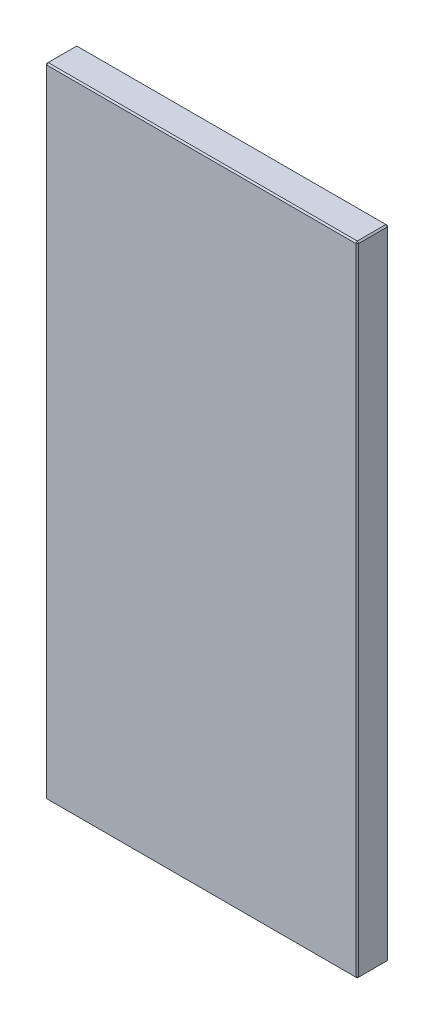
ISO-10303-21;
HEADER;
FILE_DESCRIPTION(('STEP AP214'),'2;1');
FILE_NAME('part.step','',(''),(''),'','','');
FILE_SCHEMA(('AUTOMOTIVE_DESIGN { 1 0 10303 214 1 1 1 1 }'));
ENDSEC;
DATA;
#1=APPLICATION_CONTEXT('core data for automotive mechanical design processes');
#2=APPLICATION_PROTOCOL_DEFINITION('international standard','automotive_design',2000,#1);
#3=PRODUCT_CONTEXT('',#1,'mechanical');
#4=PRODUCT('Part','Part','',(#3));
#5=PRODUCT_RELATED_PRODUCT_CATEGORY('part','',(#4));
#6=PRODUCT_DEFINITION_FORMATION('','',#4);
#7=PRODUCT_DEFINITION_CONTEXT('part definition',#1,'design');
#8=PRODUCT_DEFINITION('design','',#6,#7);
#9=PRODUCT_DEFINITION_SHAPE('','',#8);
#10=(LENGTH_UNIT() NAMED_UNIT(*) SI_UNIT(.MILLI.,.METRE.));
#11=(NAMED_UNIT(*) PLANE_ANGLE_UNIT() SI_UNIT($,.RADIAN.));
#12=(NAMED_UNIT(*) SI_UNIT($,.STERADIAN.) SOLID_ANGLE_UNIT());
#13=UNCERTAINTY_MEASURE_WITH_UNIT(LENGTH_MEASURE(1.E-05),#10,'distance_accuracy_value','');
#14=(GEOMETRIC_REPRESENTATION_CONTEXT(3) GLOBAL_UNCERTAINTY_ASSIGNED_CONTEXT((#13)) GLOBAL_UNIT_ASSIGNED_CONTEXT((#10,
#11,#12)) REPRESENTATION_CONTEXT('',''));
#15=CARTESIAN_POINT('',(0.,0.,0.));
#16=DIRECTION('',(0.,0.,1.));
#17=DIRECTION('',(1.,0.,0.));
#18=AXIS2_PLACEMENT_3D('',#15,#16,#17);
#19=CARTESIAN_POINT('',(-109.,-223.,22.));
#20=DIRECTION('',(1.,0.,0.));
#21=DIRECTION('',(0.,0.,-1.));
#22=AXIS2_PLACEMENT_3D('',#19,#20,#21);
#23=PLANE('',#22);
#24=DIRECTION('',(0.,0.,-1.));
#25=VECTOR('',#24,1.);
#26=CARTESIAN_POINT('',(-109.,222.,22.));
#27=LINE('',#26,#25);
#28=CARTESIAN_POINT('',(-109.,222.,21.));
#29=VERTEX_POINT('',#28);
#30=CARTESIAN_POINT('',(-109.,222.,0.999999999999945));
#31=VERTEX_POINT('',#30);
#32=EDGE_CURVE('E114',#29,#31,#27,.T.);
#33=ORIENTED_EDGE('',*,*,#32,.T.);
#34=DIRECTION('',(0.,-1.,0.));
#35=VECTOR('',#34,1.);
#36=CARTESIAN_POINT('',(-109.,-223.,0.999999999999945));
#37=LINE('',#36,#35);
#38=CARTESIAN_POINT('',(-109.,-222.,0.999999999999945));
#39=VERTEX_POINT('',#38);
#40=EDGE_CURVE('E110',#31,#39,#37,.T.);
#41=ORIENTED_EDGE('',*,*,#40,.T.);
#42=DIRECTION('',(0.,0.,1.));
#43=VECTOR('',#42,1.);
#44=CARTESIAN_POINT('',(-109.,-222.,22.));
#45=LINE('',#44,#43);
#46=CARTESIAN_POINT('',(-109.,-222.,21.));
#47=VERTEX_POINT('',#46);
#48=EDGE_CURVE('E103',#39,#47,#45,.T.);
#49=ORIENTED_EDGE('',*,*,#48,.T.);
#50=DIRECTION('',(0.,1.,0.));
#51=VECTOR('',#50,1.);
#52=CARTESIAN_POINT('',(-109.,223.,21.));
#53=LINE('',#52,#51);
#54=EDGE_CURVE('E107',#47,#29,#53,.T.);
#55=ORIENTED_EDGE('',*,*,#54,.T.);
#56=EDGE_LOOP('',(#33,#41,#49,#55));
#57=FACE_BOUND('',#56,.T.);
#58=ADVANCED_FACE('F15',(#57),#23,.F.);
#59=CARTESIAN_POINT('',(109.,-223.,22.));
#60=DIRECTION('',(0.,1.,0.));
#61=DIRECTION('',(-1.,0.,0.));
#62=AXIS2_PLACEMENT_3D('',#59,#60,#61);
#63=PLANE('',#62);
#64=DIRECTION('',(0.,0.,-1.));
#65=VECTOR('',#64,1.);
#66=CARTESIAN_POINT('',(-108.,-223.,22.));
#67=LINE('',#66,#65);
#68=CARTESIAN_POINT('',(-108.,-223.,21.));
#69=VERTEX_POINT('',#68);
#70=CARTESIAN_POINT('',(-108.,-223.,0.999999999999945));
#71=VERTEX_POINT('',#70);
#72=EDGE_CURVE('E122',#69,#71,#67,.T.);
#73=ORIENTED_EDGE('',*,*,#72,.T.);
#74=DIRECTION('',(1.,0.,0.));
#75=VECTOR('',#74,1.);
#76=CARTESIAN_POINT('',(109.,-223.,0.999999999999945));
#77=LINE('',#76,#75);
#78=CARTESIAN_POINT('',(108.,-223.,0.999999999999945));
#79=VERTEX_POINT('',#78);
#80=EDGE_CURVE('E160',#71,#79,#77,.T.);
#81=ORIENTED_EDGE('',*,*,#80,.T.);
#82=DIRECTION('',(0.,0.,1.));
#83=VECTOR('',#82,1.);
#84=CARTESIAN_POINT('',(108.,-223.,22.));
#85=LINE('',#84,#83);
#86=CARTESIAN_POINT('',(108.,-223.,21.));
#87=VERTEX_POINT('',#86);
#88=EDGE_CURVE('E157',#79,#87,#85,.T.);
#89=ORIENTED_EDGE('',*,*,#88,.T.);
#90=DIRECTION('',(-1.,0.,0.));
#91=VECTOR('',#90,1.);
#92=CARTESIAN_POINT('',(-109.,-223.,21.));
#93=LINE('',#92,#91);
#94=EDGE_CURVE('E155',#87,#69,#93,.T.);
#95=ORIENTED_EDGE('',*,*,#94,.T.);
#96=EDGE_LOOP('',(#73,#81,#89,#95));
#97=FACE_BOUND('',#96,.T.);
#98=ADVANCED_FACE('F277',(#97),#63,.F.);
#99=CARTESIAN_POINT('',(109.,-223.,22.));
#100=DIRECTION('',(-1.,0.,0.));
#101=DIRECTION('',(0.,0.,1.));
#102=AXIS2_PLACEMENT_3D('',#99,#100,#101);
#103=PLANE('',#102);
#104=DIRECTION('',(0.,-1.,0.));
#105=VECTOR('',#104,1.);
#106=CARTESIAN_POINT('',(109.,-223.,21.));
#107=LINE('',#106,#105);
#108=CARTESIAN_POINT('',(109.,222.,21.));
#109=VERTEX_POINT('',#108);
#110=CARTESIAN_POINT('',(109.,-222.,21.));
#111=VERTEX_POINT('',#110);
#112=EDGE_CURVE('E162',#109,#111,#107,.T.);
#113=ORIENTED_EDGE('',*,*,#112,.T.);
#114=DIRECTION('',(0.,0.,-1.));
#115=VECTOR('',#114,1.);
#116=CARTESIAN_POINT('',(109.,-222.,22.));
#117=LINE('',#116,#115);
#118=CARTESIAN_POINT('',(109.,-222.,0.999999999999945));
#119=VERTEX_POINT('',#118);
#120=EDGE_CURVE('E168',#111,#119,#117,.T.);
#121=ORIENTED_EDGE('',*,*,#120,.T.);
#122=DIRECTION('',(0.,1.,0.));
#123=VECTOR('',#122,1.);
#124=CARTESIAN_POINT('',(109.,-223.,0.999999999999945));
#125=LINE('',#124,#123);
#126=CARTESIAN_POINT('',(109.,222.,0.999999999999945));
#127=VERTEX_POINT('',#126);
#128=EDGE_CURVE('E166',#119,#127,#125,.T.);
#129=ORIENTED_EDGE('',*,*,#128,.T.);
#130=DIRECTION('',(0.,0.,1.));
#131=VECTOR('',#130,1.);
#132=CARTESIAN_POINT('',(109.,222.,22.));
#133=LINE('',#132,#131);
#134=EDGE_CURVE('E164',#127,#109,#133,.T.);
#135=ORIENTED_EDGE('',*,*,#134,.T.);
#136=EDGE_LOOP('',(#113,#121,#129,#135));
#137=FACE_BOUND('',#136,.T.);
#138=ADVANCED_FACE('F254',(#137),#103,.F.);
#139=CARTESIAN_POINT('',(109.,223.,22.));
#140=DIRECTION('',(0.,-1.,0.));
#141=DIRECTION('',(0.,0.,-1.));
#142=AXIS2_PLACEMENT_3D('',#139,#140,#141);
#143=PLANE('',#142);
#144=DIRECTION('',(-1.,0.,0.));
#145=VECTOR('',#144,1.);
#146=CARTESIAN_POINT('',(109.,223.,0.999999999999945));
#147=LINE('',#146,#145);
#148=CARTESIAN_POINT('',(108.,223.,0.999999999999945));
#149=VERTEX_POINT('',#148);
#150=CARTESIAN_POINT('',(-108.,223.,0.999999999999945));
#151=VERTEX_POINT('',#150);
#152=EDGE_CURVE('E150',#149,#151,#147,.T.);
#153=ORIENTED_EDGE('',*,*,#152,.T.);
#154=DIRECTION('',(0.,0.,1.));
#155=VECTOR('',#154,1.);
#156=CARTESIAN_POINT('',(-108.,223.,22.));
#157=LINE('',#156,#155);
#158=CARTESIAN_POINT('',(-108.,223.,21.));
#159=VERTEX_POINT('',#158);
#160=EDGE_CURVE('E152',#151,#159,#157,.T.);
#161=ORIENTED_EDGE('',*,*,#160,.T.);
#162=DIRECTION('',(1.,0.,0.));
#163=VECTOR('',#162,1.);
#164=CARTESIAN_POINT('',(109.,223.,21.));
#165=LINE('',#164,#163);
#166=CARTESIAN_POINT('',(108.,223.,21.));
#167=VERTEX_POINT('',#166);
#168=EDGE_CURVE('E146',#159,#167,#165,.T.);
#169=ORIENTED_EDGE('',*,*,#168,.T.);
#170=DIRECTION('',(0.,0.,-1.));
#171=VECTOR('',#170,1.);
#172=CARTESIAN_POINT('',(108.,223.,22.));
#173=LINE('',#172,#171);
#174=EDGE_CURVE('E148',#167,#149,#173,.T.);
#175=ORIENTED_EDGE('',*,*,#174,.T.);
#176=EDGE_LOOP('',(#153,#161,#169,#175));
#177=FACE_BOUND('',#176,.T.);
#178=ADVANCED_FACE('F286',(#177),#143,.F.);
#179=CARTESIAN_POINT('',(0.,0.,22.));
#180=DIRECTION('',(0.,0.,1.));
#181=DIRECTION('',(1.,0.,0.));
#182=AXIS2_PLACEMENT_3D('',#179,#180,#181);
#183=PLANE('',#182);
#184=DIRECTION('',(0.,1.,0.));
#185=VECTOR('',#184,1.);
#186=CARTESIAN_POINT('',(108.,223.,22.));
#187=LINE('',#186,#185);
#188=CARTESIAN_POINT('',(108.,-222.,22.));
#189=VERTEX_POINT('',#188);
#190=CARTESIAN_POINT('',(108.,222.,22.));
#191=VERTEX_POINT('',#190);
#192=EDGE_CURVE('E24',#189,#191,#187,.T.);
#193=ORIENTED_EDGE('',*,*,#192,.T.);
#194=DIRECTION('',(-1.,0.,0.));
#195=VECTOR('',#194,1.);
#196=CARTESIAN_POINT('',(-109.,222.,22.));
#197=LINE('',#196,#195);
#198=CARTESIAN_POINT('',(-108.,222.,22.));
#199=VERTEX_POINT('',#198);
#200=EDGE_CURVE('E9',#191,#199,#197,.T.);
#201=ORIENTED_EDGE('',*,*,#200,.T.);
#202=DIRECTION('',(0.,-1.,0.));
#203=VECTOR('',#202,1.);
#204=CARTESIAN_POINT('',(-108.,-223.,22.));
#205=LINE('',#204,#203);
#206=CARTESIAN_POINT('',(-108.,-222.,22.));
#207=VERTEX_POINT('',#206);
#208=EDGE_CURVE('E180',#199,#207,#205,.T.);
#209=ORIENTED_EDGE('',*,*,#208,.T.);
#210=DIRECTION('',(1.,0.,0.));
#211=VECTOR('',#210,1.);
#212=CARTESIAN_POINT('',(109.,-222.,22.));
#213=LINE('',#212,#211);
#214=EDGE_CURVE('E35',#207,#189,#213,.T.);
#215=ORIENTED_EDGE('',*,*,#214,.T.);
#216=EDGE_LOOP('',(#193,#201,#209,#215));
#217=FACE_BOUND('',#216,.T.);
#218=ADVANCED_FACE('F351',(#217),#183,.T.);
#219=CARTESIAN_POINT('',(0.,0.,0.));
#220=DIRECTION('',(0.,0.,1.));
#221=DIRECTION('',(1.,0.,0.));
#222=AXIS2_PLACEMENT_3D('',#219,#220,#221);
#223=PLANE('',#222);
#224=DIRECTION('',(0.,-1.,0.));
#225=VECTOR('',#224,1.);
#226=CARTESIAN_POINT('',(108.,0.,0.));
#227=LINE('',#226,#225);
#228=CARTESIAN_POINT('',(108.,222.,0.));
#229=VERTEX_POINT('',#228);
#230=CARTESIAN_POINT('',(108.,-222.,0.));
#231=VERTEX_POINT('',#230);
#232=EDGE_CURVE('E175',#229,#231,#227,.T.);
#233=ORIENTED_EDGE('',*,*,#232,.T.);
#234=DIRECTION('',(-1.,0.,0.));
#235=VECTOR('',#234,1.);
#236=CARTESIAN_POINT('',(0.,-222.,0.));
#237=LINE('',#236,#235);
#238=CARTESIAN_POINT('',(-108.,-222.,0.));
#239=VERTEX_POINT('',#238);
#240=EDGE_CURVE('E177',#231,#239,#237,.T.);
#241=ORIENTED_EDGE('',*,*,#240,.T.);
#242=DIRECTION('',(0.,1.,0.));
#243=VECTOR('',#242,1.);
#244=CARTESIAN_POINT('',(-108.,0.,0.));
#245=LINE('',#244,#243);
#246=CARTESIAN_POINT('',(-108.,222.,0.));
#247=VERTEX_POINT('',#246);
#248=EDGE_CURVE('E173',#239,#247,#245,.T.);
#249=ORIENTED_EDGE('',*,*,#248,.T.);
#250=DIRECTION('',(1.,0.,0.));
#251=VECTOR('',#250,1.);
#252=CARTESIAN_POINT('',(0.,222.,0.));
#253=LINE('',#252,#251);
#254=EDGE_CURVE('E171',#247,#229,#253,.T.);
#255=ORIENTED_EDGE('',*,*,#254,.T.);
#256=EDGE_LOOP('',(#233,#241,#249,#255));
#257=FACE_BOUND('',#256,.T.);
#258=ADVANCED_FACE('F246',(#257),#223,.F.);
#259=CARTESIAN_POINT('',(109.,-222.,22.));
#260=DIRECTION('',(-0.707106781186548,0.707106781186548,0.));
#261=DIRECTION('',(0.,0.,-1.));
#262=AXIS2_PLACEMENT_3D('',#259,#260,#261);
#263=PLANE('',#262);
#264=DIRECTION('',(-0.707106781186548,-0.707106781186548,0.));
#265=VECTOR('',#264,1.);
#266=CARTESIAN_POINT('',(108.,-223.,21.));
#267=LINE('',#266,#265);
#268=EDGE_CURVE('E19',#87,#111,#267,.F.);
#269=ORIENTED_EDGE('',*,*,#268,.F.);
#270=ORIENTED_EDGE('',*,*,#88,.F.);
#271=DIRECTION('',(0.707106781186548,0.707106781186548,0.));
#272=VECTOR('',#271,1.);
#273=CARTESIAN_POINT('',(109.,-222.,0.999999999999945));
#274=LINE('',#273,#272);
#275=EDGE_CURVE('E142',#119,#79,#274,.F.);
#276=ORIENTED_EDGE('',*,*,#275,.F.);
#277=ORIENTED_EDGE('',*,*,#120,.F.);
#278=EDGE_LOOP('',(#269,#270,#276,#277));
#279=FACE_BOUND('',#278,.T.);
#280=ADVANCED_FACE('F17',(#279),#263,.F.);
#281=CARTESIAN_POINT('',(108.,-223.,21.));
#282=DIRECTION('',(0.577350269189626,-0.577350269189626,0.577350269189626));
#283=DIRECTION('',(0.707106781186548,0.,-0.707106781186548));
#284=AXIS2_PLACEMENT_3D('',#281,#282,#283);
#285=PLANE('',#284);
#286=DIRECTION('',(0.,-0.707106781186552,-0.707106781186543));
#287=VECTOR('',#286,1.);
#288=CARTESIAN_POINT('',(108.,-223.,21.));
#289=LINE('',#288,#287);
#290=EDGE_CURVE('E227',#87,#189,#289,.F.);
#291=ORIENTED_EDGE('',*,*,#290,.F.);
#292=ORIENTED_EDGE('',*,*,#268,.T.);
#293=DIRECTION('',(-0.707106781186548,0.,0.707106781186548));
#294=VECTOR('',#293,1.);
#295=CARTESIAN_POINT('',(108.5,-222.,21.5));
#296=LINE('',#295,#294);
#297=EDGE_CURVE('E229',#189,#111,#296,.F.);
#298=ORIENTED_EDGE('',*,*,#297,.F.);
#299=EDGE_LOOP('',(#291,#292,#298));
#300=FACE_BOUND('',#299,.T.);
#301=ADVANCED_FACE('F272',(#300),#285,.T.);
#302=CARTESIAN_POINT('',(109.,-222.,0.999999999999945));
#303=DIRECTION('',(0.577350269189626,-0.577350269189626,-0.577350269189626));
#304=DIRECTION('',(-0.707106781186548,0.,-0.707106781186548));
#305=AXIS2_PLACEMENT_3D('',#302,#303,#304);
#306=PLANE('',#305);
#307=DIRECTION('',(-0.707106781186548,0.,-0.707106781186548));
#308=VECTOR('',#307,1.);
#309=CARTESIAN_POINT('',(109.,-222.,0.999999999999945));
#310=LINE('',#309,#308);
#311=EDGE_CURVE('E221',#119,#231,#310,.T.);
#312=ORIENTED_EDGE('',*,*,#311,.F.);
#313=ORIENTED_EDGE('',*,*,#275,.T.);
#314=DIRECTION('',(0.,-0.707106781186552,0.707106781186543));
#315=VECTOR('',#314,1.);
#316=CARTESIAN_POINT('',(108.,-222.5,0.499999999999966));
#317=LINE('',#316,#315);
#318=EDGE_CURVE('E224',#231,#79,#317,.T.);
#319=ORIENTED_EDGE('',*,*,#318,.F.);
#320=EDGE_LOOP('',(#312,#313,#319));
#321=FACE_BOUND('',#320,.T.);
#322=ADVANCED_FACE('F236',(#321),#306,.T.);
#323=CARTESIAN_POINT('',(108.,0.,22.));
#324=DIRECTION('',(0.707106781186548,0.,0.707106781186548));
#325=DIRECTION('',(0.,-1.,0.));
#326=AXIS2_PLACEMENT_3D('',#323,#324,#325);
#327=PLANE('',#326);
#328=ORIENTED_EDGE('',*,*,#297,.T.);
#329=ORIENTED_EDGE('',*,*,#112,.F.);
#330=DIRECTION('',(0.707106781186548,0.,-0.707106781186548));
#331=VECTOR('',#330,1.);
#332=CARTESIAN_POINT('',(109.,222.,21.));
#333=LINE('',#332,#331);
#334=EDGE_CURVE('E215',#191,#109,#333,.T.);
#335=ORIENTED_EDGE('',*,*,#334,.F.);
#336=ORIENTED_EDGE('',*,*,#192,.F.);
#337=EDGE_LOOP('',(#328,#329,#335,#336));
#338=FACE_BOUND('',#337,.T.);
#339=ADVANCED_FACE('F267',(#338),#327,.T.);
#340=CARTESIAN_POINT('',(0.,-222.,22.));
#341=DIRECTION('',(0.,-0.707106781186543,0.707106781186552));
#342=DIRECTION('',(-1.,0.,0.));
#343=AXIS2_PLACEMENT_3D('',#340,#341,#342);
#344=PLANE('',#343);
#345=ORIENTED_EDGE('',*,*,#290,.T.);
#346=ORIENTED_EDGE('',*,*,#214,.F.);
#347=DIRECTION('',(0.,0.707106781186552,0.707106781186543));
#348=VECTOR('',#347,1.);
#349=CARTESIAN_POINT('',(-108.,-222.5,21.5));
#350=LINE('',#349,#348);
#351=EDGE_CURVE('E126',#69,#207,#350,.T.);
#352=ORIENTED_EDGE('',*,*,#351,.F.);
#353=ORIENTED_EDGE('',*,*,#94,.F.);
#354=EDGE_LOOP('',(#345,#346,#352,#353));
#355=FACE_BOUND('',#354,.T.);
#356=ADVANCED_FACE('F275',(#355),#344,.T.);
#357=CARTESIAN_POINT('',(-108.,-223.,22.));
#358=DIRECTION('',(0.707106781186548,0.707106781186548,0.));
#359=DIRECTION('',(0.,0.,-1.));
#360=AXIS2_PLACEMENT_3D('',#357,#358,#359);
#361=PLANE('',#360);
#362=DIRECTION('',(0.707106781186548,-0.707106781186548,0.));
#363=VECTOR('',#362,1.);
#364=CARTESIAN_POINT('',(-108.,-223.,0.999999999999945));
#365=LINE('',#364,#363);
#366=EDGE_CURVE('E127',#71,#39,#365,.F.);
#367=ORIENTED_EDGE('',*,*,#366,.F.);
#368=ORIENTED_EDGE('',*,*,#72,.F.);
#369=DIRECTION('',(-0.707106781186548,0.707106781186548,0.));
#370=VECTOR('',#369,1.);
#371=CARTESIAN_POINT('',(-109.,-222.,21.));
#372=LINE('',#371,#370);
#373=EDGE_CURVE('E118',#47,#69,#372,.F.);
#374=ORIENTED_EDGE('',*,*,#373,.F.);
#375=ORIENTED_EDGE('',*,*,#48,.F.);
#376=EDGE_LOOP('',(#367,#368,#374,#375));
#377=FACE_BOUND('',#376,.T.);
#378=ADVANCED_FACE('F120',(#377),#361,.F.);
#379=CARTESIAN_POINT('',(109.,-223.,0.999999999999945));
#380=DIRECTION('',(0.,0.707106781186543,0.707106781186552));
#381=DIRECTION('',(1.,0.,0.));
#382=AXIS2_PLACEMENT_3D('',#379,#380,#381);
#383=PLANE('',#382);
#384=ORIENTED_EDGE('',*,*,#318,.T.);
#385=ORIENTED_EDGE('',*,*,#80,.F.);
#386=DIRECTION('',(0.,0.707106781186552,-0.707106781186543));
#387=VECTOR('',#386,1.);
#388=CARTESIAN_POINT('',(-108.,-223.,0.999999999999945));
#389=LINE('',#388,#387);
#390=EDGE_CURVE('E211',#239,#71,#389,.F.);
#391=ORIENTED_EDGE('',*,*,#390,.F.);
#392=ORIENTED_EDGE('',*,*,#240,.F.);
#393=EDGE_LOOP('',(#384,#385,#391,#392));
#394=FACE_BOUND('',#393,.T.);
#395=ADVANCED_FACE('F243',(#394),#383,.F.);
#396=CARTESIAN_POINT('',(109.,-223.,0.999999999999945));
#397=DIRECTION('',(-0.707106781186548,0.,0.707106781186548));
#398=DIRECTION('',(0.,1.,0.));
#399=AXIS2_PLACEMENT_3D('',#396,#397,#398);
#400=PLANE('',#399);
#401=ORIENTED_EDGE('',*,*,#311,.T.);
#402=ORIENTED_EDGE('',*,*,#232,.F.);
#403=DIRECTION('',(0.707106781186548,0.,0.707106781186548));
#404=VECTOR('',#403,1.);
#405=CARTESIAN_POINT('',(109.,222.,0.999999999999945));
#406=LINE('',#405,#404);
#407=EDGE_CURVE('E208',#127,#229,#406,.F.);
#408=ORIENTED_EDGE('',*,*,#407,.F.);
#409=ORIENTED_EDGE('',*,*,#128,.F.);
#410=EDGE_LOOP('',(#401,#402,#408,#409));
#411=FACE_BOUND('',#410,.T.);
#412=ADVANCED_FACE('F251',(#411),#400,.F.);
#413=CARTESIAN_POINT('',(108.,223.,22.));
#414=DIRECTION('',(-0.707106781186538,-0.707106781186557,0.));
#415=DIRECTION('',(0.,0.,-1.));
#416=AXIS2_PLACEMENT_3D('',#413,#414,#415);
#417=PLANE('',#416);
#418=DIRECTION('',(0.707106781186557,-0.707106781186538,0.));
#419=VECTOR('',#418,1.);
#420=CARTESIAN_POINT('',(109.,222.,21.));
#421=LINE('',#420,#419);
#422=EDGE_CURVE('E218',#109,#167,#421,.F.);
#423=ORIENTED_EDGE('',*,*,#422,.F.);
#424=ORIENTED_EDGE('',*,*,#134,.F.);
#425=DIRECTION('',(-0.707106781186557,0.707106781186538,0.));
#426=VECTOR('',#425,1.);
#427=CARTESIAN_POINT('',(109.,222.,0.999999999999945));
#428=LINE('',#427,#426);
#429=EDGE_CURVE('E205',#149,#127,#428,.F.);
#430=ORIENTED_EDGE('',*,*,#429,.F.);
#431=ORIENTED_EDGE('',*,*,#174,.F.);
#432=EDGE_LOOP('',(#423,#424,#430,#431));
#433=FACE_BOUND('',#432,.T.);
#434=ADVANCED_FACE('F259',(#433),#417,.F.);
#435=CARTESIAN_POINT('',(109.,222.,21.));
#436=DIRECTION('',(0.577350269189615,0.577350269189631,0.577350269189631));
#437=DIRECTION('',(0.,-0.707106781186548,0.707106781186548));
#438=AXIS2_PLACEMENT_3D('',#435,#436,#437);
#439=PLANE('',#438);
#440=ORIENTED_EDGE('',*,*,#334,.T.);
#441=ORIENTED_EDGE('',*,*,#422,.T.);
#442=DIRECTION('',(0.,-0.707106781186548,0.707106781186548));
#443=VECTOR('',#442,1.);
#444=CARTESIAN_POINT('',(108.,222.5,21.5));
#445=LINE('',#444,#443);
#446=EDGE_CURVE('E134',#191,#167,#445,.F.);
#447=ORIENTED_EDGE('',*,*,#446,.F.);
#448=EDGE_LOOP('',(#440,#441,#447));
#449=FACE_BOUND('',#448,.T.);
#450=ADVANCED_FACE('F264',(#449),#439,.T.);
#451=CARTESIAN_POINT('',(-109.,-222.,21.));
#452=DIRECTION('',(-0.577350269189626,-0.577350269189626,0.577350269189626));
#453=DIRECTION('',(0.707106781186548,0.,0.707106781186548));
#454=AXIS2_PLACEMENT_3D('',#451,#452,#453);
#455=PLANE('',#454);
#456=ORIENTED_EDGE('',*,*,#373,.T.);
#457=ORIENTED_EDGE('',*,*,#351,.T.);
#458=DIRECTION('',(-0.707106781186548,0.,-0.707106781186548));
#459=VECTOR('',#458,1.);
#460=CARTESIAN_POINT('',(-109.,-222.,21.));
#461=LINE('',#460,#459);
#462=EDGE_CURVE('E130',#47,#207,#461,.F.);
#463=ORIENTED_EDGE('',*,*,#462,.F.);
#464=EDGE_LOOP('',(#456,#457,#463));
#465=FACE_BOUND('',#464,.T.);
#466=ADVANCED_FACE('F131',(#465),#455,.T.);
#467=CARTESIAN_POINT('',(-108.,-223.,0.999999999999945));
#468=DIRECTION('',(-0.577350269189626,-0.577350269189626,-0.577350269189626));
#469=DIRECTION('',(-0.707106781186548,0.,0.707106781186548));
#470=AXIS2_PLACEMENT_3D('',#467,#468,#469);
#471=PLANE('',#470);
#472=ORIENTED_EDGE('',*,*,#390,.T.);
#473=ORIENTED_EDGE('',*,*,#366,.T.);
#474=DIRECTION('',(-0.707106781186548,0.,0.707106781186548));
#475=VECTOR('',#474,1.);
#476=CARTESIAN_POINT('',(-108.5,-222.,0.499999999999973));
#477=LINE('',#476,#475);
#478=EDGE_CURVE('E135',#239,#39,#477,.T.);
#479=ORIENTED_EDGE('',*,*,#478,.F.);
#480=EDGE_LOOP('',(#472,#473,#479));
#481=FACE_BOUND('',#480,.T.);
#482=ADVANCED_FACE('F320',(#481),#471,.T.);
#483=CARTESIAN_POINT('',(109.,222.,0.999999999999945));
#484=DIRECTION('',(0.577350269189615,0.577350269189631,-0.577350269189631));
#485=DIRECTION('',(0.,0.707106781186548,0.707106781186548));
#486=AXIS2_PLACEMENT_3D('',#483,#484,#485);
#487=PLANE('',#486);
#488=ORIENTED_EDGE('',*,*,#429,.T.);
#489=ORIENTED_EDGE('',*,*,#407,.T.);
#490=DIRECTION('',(0.,-0.707106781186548,-0.707106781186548));
#491=VECTOR('',#490,1.);
#492=CARTESIAN_POINT('',(108.,222.5,0.499999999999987));
#493=LINE('',#492,#491);
#494=EDGE_CURVE('E198',#149,#229,#493,.T.);
#495=ORIENTED_EDGE('',*,*,#494,.F.);
#496=EDGE_LOOP('',(#488,#489,#495));
#497=FACE_BOUND('',#496,.T.);
#498=ADVANCED_FACE('F316',(#497),#487,.T.);
#499=CARTESIAN_POINT('',(0.,222.,22.));
#500=DIRECTION('',(0.,0.707106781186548,0.707106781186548));
#501=DIRECTION('',(1.,0.,0.));
#502=AXIS2_PLACEMENT_3D('',#499,#500,#501);
#503=PLANE('',#502);
#504=ORIENTED_EDGE('',*,*,#446,.T.);
#505=ORIENTED_EDGE('',*,*,#168,.F.);
#506=DIRECTION('',(0.,0.707106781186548,-0.707106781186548));
#507=VECTOR('',#506,1.);
#508=CARTESIAN_POINT('',(-108.,223.,21.));
#509=LINE('',#508,#507);
#510=EDGE_CURVE('E195',#199,#159,#509,.T.);
#511=ORIENTED_EDGE('',*,*,#510,.F.);
#512=ORIENTED_EDGE('',*,*,#200,.F.);
#513=EDGE_LOOP('',(#504,#505,#511,#512));
#514=FACE_BOUND('',#513,.T.);
#515=ADVANCED_FACE('F313',(#514),#503,.T.);
#516=CARTESIAN_POINT('',(-108.,0.,22.));
#517=DIRECTION('',(-0.707106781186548,0.,0.707106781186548));
#518=DIRECTION('',(0.,1.,0.));
#519=AXIS2_PLACEMENT_3D('',#516,#517,#518);
#520=PLANE('',#519);
#521=ORIENTED_EDGE('',*,*,#462,.T.);
#522=ORIENTED_EDGE('',*,*,#208,.F.);
#523=DIRECTION('',(0.707106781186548,0.,0.707106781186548));
#524=VECTOR('',#523,1.);
#525=CARTESIAN_POINT('',(-108.5,222.,21.5));
#526=LINE('',#525,#524);
#527=EDGE_CURVE('E138',#29,#199,#526,.T.);
#528=ORIENTED_EDGE('',*,*,#527,.F.);
#529=ORIENTED_EDGE('',*,*,#54,.F.);
#530=EDGE_LOOP('',(#521,#522,#528,#529));
#531=FACE_BOUND('',#530,.T.);
#532=ADVANCED_FACE('F137',(#531),#520,.T.);
#533=CARTESIAN_POINT('',(-109.,-223.,0.999999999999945));
#534=DIRECTION('',(0.707106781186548,0.,0.707106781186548));
#535=DIRECTION('',(0.,-1.,0.));
#536=AXIS2_PLACEMENT_3D('',#533,#534,#535);
#537=PLANE('',#536);
#538=ORIENTED_EDGE('',*,*,#478,.T.);
#539=ORIENTED_EDGE('',*,*,#40,.F.);
#540=DIRECTION('',(0.707106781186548,0.,-0.707106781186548));
#541=VECTOR('',#540,1.);
#542=CARTESIAN_POINT('',(-109.,222.,0.999999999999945));
#543=LINE('',#542,#541);
#544=EDGE_CURVE('E191',#247,#31,#543,.F.);
#545=ORIENTED_EDGE('',*,*,#544,.F.);
#546=ORIENTED_EDGE('',*,*,#248,.F.);
#547=EDGE_LOOP('',(#538,#539,#545,#546));
#548=FACE_BOUND('',#547,.T.);
#549=ADVANCED_FACE('F306',(#548),#537,.F.);
#550=CARTESIAN_POINT('',(109.,223.,0.999999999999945));
#551=DIRECTION('',(0.,-0.707106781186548,0.707106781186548));
#552=DIRECTION('',(-1.,0.,0.));
#553=AXIS2_PLACEMENT_3D('',#550,#551,#552);
#554=PLANE('',#553);
#555=ORIENTED_EDGE('',*,*,#494,.T.);
#556=ORIENTED_EDGE('',*,*,#254,.F.);
#557=DIRECTION('',(0.,0.707106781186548,0.707106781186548));
#558=VECTOR('',#557,1.);
#559=CARTESIAN_POINT('',(-108.,222.5,0.499999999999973));
#560=LINE('',#559,#558);
#561=EDGE_CURVE('E188',#151,#247,#560,.F.);
#562=ORIENTED_EDGE('',*,*,#561,.F.);
#563=ORIENTED_EDGE('',*,*,#152,.F.);
#564=EDGE_LOOP('',(#555,#556,#562,#563));
#565=FACE_BOUND('',#564,.T.);
#566=ADVANCED_FACE('F302',(#565),#554,.F.);
#567=CARTESIAN_POINT('',(-108.,223.,21.));
#568=DIRECTION('',(-0.577350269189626,0.577350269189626,0.577350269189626));
#569=DIRECTION('',(0.707106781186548,0.,0.707106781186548));
#570=AXIS2_PLACEMENT_3D('',#567,#568,#569);
#571=PLANE('',#570);
#572=ORIENTED_EDGE('',*,*,#527,.T.);
#573=ORIENTED_EDGE('',*,*,#510,.T.);
#574=DIRECTION('',(0.707106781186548,0.707106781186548,0.));
#575=VECTOR('',#574,1.);
#576=CARTESIAN_POINT('',(-108.,223.,21.));
#577=LINE('',#576,#575);
#578=EDGE_CURVE('E186',#29,#159,#577,.T.);
#579=ORIENTED_EDGE('',*,*,#578,.F.);
#580=EDGE_LOOP('',(#572,#573,#579));
#581=FACE_BOUND('',#580,.T.);
#582=ADVANCED_FACE('F298',(#581),#571,.T.);
#583=CARTESIAN_POINT('',(-109.,222.,0.999999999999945));
#584=DIRECTION('',(-0.577350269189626,0.577350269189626,-0.577350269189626));
#585=DIRECTION('',(-0.707106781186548,0.,0.707106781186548));
#586=AXIS2_PLACEMENT_3D('',#583,#584,#585);
#587=PLANE('',#586);
#588=ORIENTED_EDGE('',*,*,#561,.T.);
#589=ORIENTED_EDGE('',*,*,#544,.T.);
#590=DIRECTION('',(-0.707106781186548,-0.707106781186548,0.));
#591=VECTOR('',#590,1.);
#592=CARTESIAN_POINT('',(-109.,222.,0.999999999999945));
#593=LINE('',#592,#591);
#594=EDGE_CURVE('E184',#151,#31,#593,.T.);
#595=ORIENTED_EDGE('',*,*,#594,.F.);
#596=EDGE_LOOP('',(#588,#589,#595));
#597=FACE_BOUND('',#596,.T.);
#598=ADVANCED_FACE('F294',(#597),#587,.T.);
#599=CARTESIAN_POINT('',(-109.,222.,22.));
#600=DIRECTION('',(0.707106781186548,-0.707106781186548,0.));
#601=DIRECTION('',(0.,0.,-1.));
#602=AXIS2_PLACEMENT_3D('',#599,#600,#601);
#603=PLANE('',#602);
#604=ORIENTED_EDGE('',*,*,#578,.T.);
#605=ORIENTED_EDGE('',*,*,#160,.F.);
#606=ORIENTED_EDGE('',*,*,#594,.T.);
#607=ORIENTED_EDGE('',*,*,#32,.F.);
#608=EDGE_LOOP('',(#604,#605,#606,#607));
#609=FACE_BOUND('',#608,.T.);
#610=ADVANCED_FACE('F291',(#609),#603,.F.);
#611=CLOSED_SHELL('',(#58,#98,#138,#178,#218,#258,#280,#301,#322,#339,#356,#378,#395,#412,#434,
#450,#466,#482,#498,#515,#532,#549,#566,#582,#598,#610));
#612=MANIFOLD_SOLID_BREP('B1',#611);
#613=ADVANCED_BREP_SHAPE_REPRESENTATION('',(#18,#612),#14);
#614=SHAPE_DEFINITION_REPRESENTATION(#9,#613);
ENDSEC;
END-ISO-10303-21;
